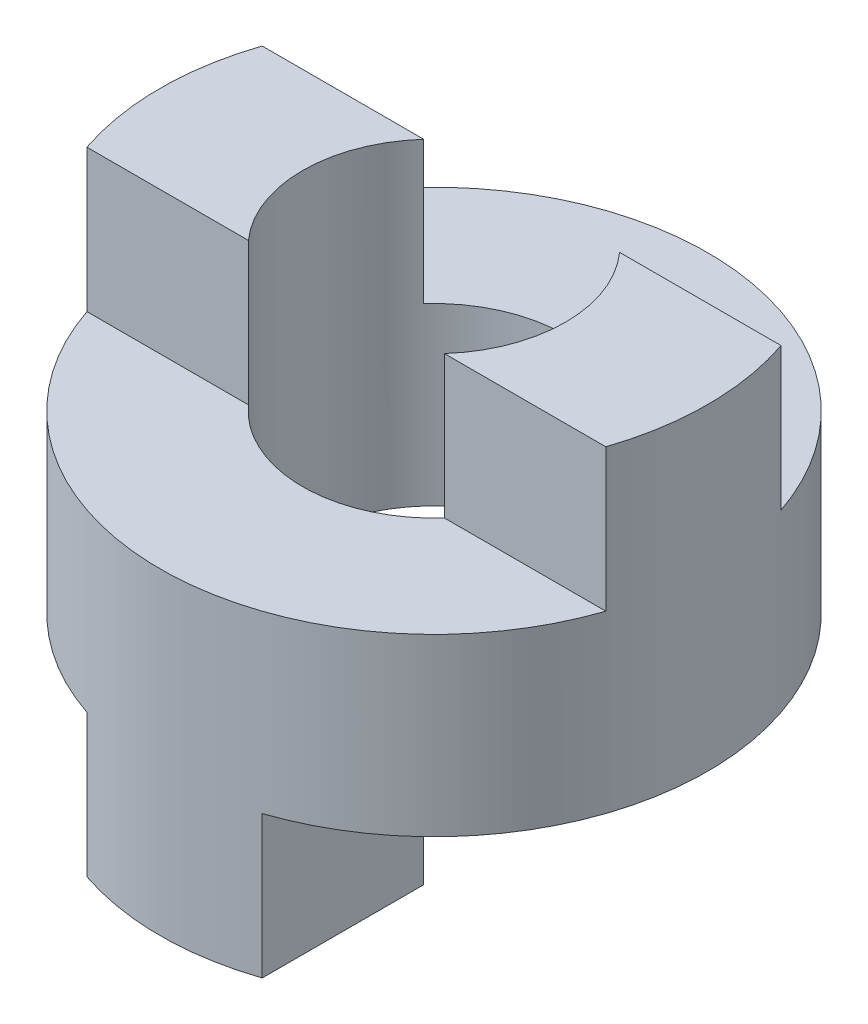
ISO-10303-21;
HEADER;
FILE_DESCRIPTION(('STEP AP214'),'2;1');
FILE_NAME('part.step','',(''),(''),'','','');
FILE_SCHEMA(('AUTOMOTIVE_DESIGN { 1 0 10303 214 1 1 1 1 }'));
ENDSEC;
DATA;
#1=APPLICATION_CONTEXT('core data for automotive mechanical design processes');
#2=APPLICATION_PROTOCOL_DEFINITION('international standard','automotive_design',2000,#1);
#3=PRODUCT_CONTEXT('',#1,'mechanical');
#4=PRODUCT('Part','Part','',(#3));
#5=PRODUCT_RELATED_PRODUCT_CATEGORY('part','',(#4));
#6=PRODUCT_DEFINITION_FORMATION('','',#4);
#7=PRODUCT_DEFINITION_CONTEXT('part definition',#1,'design');
#8=PRODUCT_DEFINITION('design','',#6,#7);
#9=PRODUCT_DEFINITION_SHAPE('','',#8);
#10=(LENGTH_UNIT() NAMED_UNIT(*) SI_UNIT(.MILLI.,.METRE.));
#11=(NAMED_UNIT(*) PLANE_ANGLE_UNIT() SI_UNIT($,.RADIAN.));
#12=(NAMED_UNIT(*) SI_UNIT($,.STERADIAN.) SOLID_ANGLE_UNIT());
#13=UNCERTAINTY_MEASURE_WITH_UNIT(LENGTH_MEASURE(1.E-05),#10,'distance_accuracy_value','');
#14=(GEOMETRIC_REPRESENTATION_CONTEXT(3) GLOBAL_UNCERTAINTY_ASSIGNED_CONTEXT((#13)) GLOBAL_UNIT_ASSIGNED_CONTEXT((#10,
#11,#12)) REPRESENTATION_CONTEXT('',''));
#15=CARTESIAN_POINT('',(0.,0.,0.));
#16=DIRECTION('',(0.,0.,1.));
#17=DIRECTION('',(1.,0.,0.));
#18=AXIS2_PLACEMENT_3D('',#15,#16,#17);
#19=CARTESIAN_POINT('',(0.,42.,0.));
#20=DIRECTION('',(0.,1.,0.));
#21=DIRECTION('',(0.,0.,1.));
#22=AXIS2_PLACEMENT_3D('',#19,#20,#21);
#23=PLANE('',#22);
#24=DIRECTION('',(1.,0.,0.));
#25=VECTOR('',#24,1.);
#26=CARTESIAN_POINT('',(-40.,42.,-8.));
#27=LINE('',#26,#25);
#28=CARTESIAN_POINT('',(-23.685438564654,42.,-8.));
#29=VERTEX_POINT('',#28);
#30=CARTESIAN_POINT('',(-8.94427190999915,42.,-8.));
#31=VERTEX_POINT('',#30);
#32=EDGE_CURVE('E150',#29,#31,#27,.T.);
#33=ORIENTED_EDGE('',*,*,#32,.F.);
#34=CARTESIAN_POINT('',(0.,42.,0.));
#35=DIRECTION('',(0.,1.,0.));
#36=DIRECTION('',(0.,0.,1.));
#37=AXIS2_PLACEMENT_3D('',#34,#35,#36);
#38=CIRCLE('',#37,25.);
#39=CARTESIAN_POINT('',(-23.685438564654,42.,8.));
#40=VERTEX_POINT('',#39);
#41=EDGE_CURVE('E163',#29,#40,#38,.T.);
#42=ORIENTED_EDGE('',*,*,#41,.T.);
#43=DIRECTION('',(1.,0.,0.));
#44=VECTOR('',#43,1.);
#45=CARTESIAN_POINT('',(-40.,42.,8.));
#46=LINE('',#45,#44);
#47=CARTESIAN_POINT('',(-8.94427190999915,42.,8.));
#48=VERTEX_POINT('',#47);
#49=EDGE_CURVE('E171',#40,#48,#46,.T.);
#50=ORIENTED_EDGE('',*,*,#49,.T.);
#51=CARTESIAN_POINT('',(0.,42.,0.));
#52=DIRECTION('',(0.,1.,0.));
#53=DIRECTION('',(0.,0.,1.));
#54=AXIS2_PLACEMENT_3D('',#51,#52,#53);
#55=CIRCLE('',#54,12.);
#56=EDGE_CURVE('E219',#31,#48,#55,.T.);
#57=ORIENTED_EDGE('',*,*,#56,.F.);
#58=EDGE_LOOP('',(#33,#42,#50,#57));
#59=FACE_BOUND('',#58,.T.);
#60=ADVANCED_FACE('F31',(#59),#23,.T.);
#61=CARTESIAN_POINT('',(0.,0.,0.));
#62=DIRECTION('',(0.,1.,0.));
#63=DIRECTION('',(0.,0.,1.));
#64=AXIS2_PLACEMENT_3D('',#61,#62,#63);
#65=PLANE('',#64);
#66=CARTESIAN_POINT('',(0.,0.,0.));
#67=DIRECTION('',(0.,1.,0.));
#68=DIRECTION('',(0.,0.,1.));
#69=AXIS2_PLACEMENT_3D('',#66,#67,#68);
#70=CIRCLE('',#69,25.);
#71=CARTESIAN_POINT('',(-8.,0.,23.685438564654));
#72=VERTEX_POINT('',#71);
#73=CARTESIAN_POINT('',(8.,0.,23.685438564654));
#74=VERTEX_POINT('',#73);
#75=EDGE_CURVE('E218',#72,#74,#70,.T.);
#76=ORIENTED_EDGE('',*,*,#75,.F.);
#77=DIRECTION('',(0.,0.,-1.));
#78=VECTOR('',#77,1.);
#79=CARTESIAN_POINT('',(-8.,0.,0.));
#80=LINE('',#79,#78);
#81=CARTESIAN_POINT('',(-8.,0.,8.94427190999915));
#82=VERTEX_POINT('',#81);
#83=EDGE_CURVE('E188',#72,#82,#80,.T.);
#84=ORIENTED_EDGE('',*,*,#83,.T.);
#85=CARTESIAN_POINT('',(0.,0.,0.));
#86=DIRECTION('',(0.,1.,0.));
#87=DIRECTION('',(0.,0.,1.));
#88=AXIS2_PLACEMENT_3D('',#85,#86,#87);
#89=CIRCLE('',#88,12.);
#90=CARTESIAN_POINT('',(8.,0.,8.94427190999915));
#91=VERTEX_POINT('',#90);
#92=EDGE_CURVE('E214',#82,#91,#89,.T.);
#93=ORIENTED_EDGE('',*,*,#92,.T.);
#94=DIRECTION('',(0.,0.,1.));
#95=VECTOR('',#94,1.);
#96=CARTESIAN_POINT('',(8.,0.,0.));
#97=LINE('',#96,#95);
#98=EDGE_CURVE('E204',#91,#74,#97,.T.);
#99=ORIENTED_EDGE('',*,*,#98,.T.);
#100=EDGE_LOOP('',(#76,#84,#93,#99));
#101=FACE_BOUND('',#100,.T.);
#102=ADVANCED_FACE('F285',(#101),#65,.F.);
#103=CARTESIAN_POINT('',(8.94427190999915,42.,-8.));
#104=VERTEX_POINT('',#103);
#105=CARTESIAN_POINT('',(23.685438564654,42.,-8.));
#106=VERTEX_POINT('',#105);
#107=EDGE_CURVE('E158',#104,#106,#27,.T.);
#108=ORIENTED_EDGE('',*,*,#107,.F.);
#109=CARTESIAN_POINT('',(8.94427190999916,42.,8.));
#110=VERTEX_POINT('',#109);
#111=EDGE_CURVE('E215',#110,#104,#55,.T.);
#112=ORIENTED_EDGE('',*,*,#111,.F.);
#113=CARTESIAN_POINT('',(23.685438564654,42.,8.));
#114=VERTEX_POINT('',#113);
#115=EDGE_CURVE('E169',#110,#114,#46,.T.);
#116=ORIENTED_EDGE('',*,*,#115,.T.);
#117=EDGE_CURVE('E223',#114,#106,#38,.T.);
#118=ORIENTED_EDGE('',*,*,#117,.T.);
#119=EDGE_LOOP('',(#108,#112,#116,#118));
#120=FACE_BOUND('',#119,.T.);
#121=ADVANCED_FACE('F257',(#120),#23,.T.);
#122=CARTESIAN_POINT('',(8.,0.,-8.94427190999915));
#123=VERTEX_POINT('',#122);
#124=CARTESIAN_POINT('',(-8.,0.,-8.94427190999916));
#125=VERTEX_POINT('',#124);
#126=EDGE_CURVE('E220',#123,#125,#89,.T.);
#127=ORIENTED_EDGE('',*,*,#126,.T.);
#128=CARTESIAN_POINT('',(-8.,0.,-23.685438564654));
#129=VERTEX_POINT('',#128);
#130=EDGE_CURVE('E184',#125,#129,#80,.T.);
#131=ORIENTED_EDGE('',*,*,#130,.T.);
#132=CARTESIAN_POINT('',(8.,0.,-23.685438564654));
#133=VERTEX_POINT('',#132);
#134=EDGE_CURVE('E227',#133,#129,#70,.T.);
#135=ORIENTED_EDGE('',*,*,#134,.F.);
#136=EDGE_CURVE('E208',#133,#123,#97,.T.);
#137=ORIENTED_EDGE('',*,*,#136,.T.);
#138=EDGE_LOOP('',(#127,#131,#135,#137));
#139=FACE_BOUND('',#138,.T.);
#140=ADVANCED_FACE('F292',(#139),#65,.F.);
#141=CARTESIAN_POINT('',(0.,42.,0.));
#142=DIRECTION('',(0.,-1.,0.));
#143=DIRECTION('',(0.,0.,-1.));
#144=AXIS2_PLACEMENT_3D('',#141,#142,#143);
#145=CYLINDRICAL_SURFACE('',#144,25.);
#146=ORIENTED_EDGE('',*,*,#41,.F.);
#147=DIRECTION('',(0.,-1.,0.));
#148=VECTOR('',#147,1.);
#149=CARTESIAN_POINT('',(-23.685438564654,42.,-8.));
#150=LINE('',#149,#148);
#151=CARTESIAN_POINT('',(-23.685438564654,29.,-8.));
#152=VERTEX_POINT('',#151);
#153=EDGE_CURVE('E154',#29,#152,#150,.T.);
#154=ORIENTED_EDGE('',*,*,#153,.T.);
#155=CARTESIAN_POINT('',(0.,29.,0.));
#156=DIRECTION('',(0.,-1.,0.));
#157=DIRECTION('',(0.,0.,-1.));
#158=AXIS2_PLACEMENT_3D('',#155,#156,#157);
#159=CIRCLE('',#158,25.);
#160=CARTESIAN_POINT('',(23.685438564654,29.,-8.));
#161=VERTEX_POINT('',#160);
#162=EDGE_CURVE('E141',#152,#161,#159,.T.);
#163=ORIENTED_EDGE('',*,*,#162,.T.);
#164=DIRECTION('',(0.,-1.,0.));
#165=VECTOR('',#164,1.);
#166=CARTESIAN_POINT('',(23.685438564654,42.,-8.));
#167=LINE('',#166,#165);
#168=EDGE_CURVE('E149',#161,#106,#167,.F.);
#169=ORIENTED_EDGE('',*,*,#168,.T.);
#170=ORIENTED_EDGE('',*,*,#117,.F.);
#171=DIRECTION('',(0.,-1.,0.));
#172=VECTOR('',#171,1.);
#173=CARTESIAN_POINT('',(23.685438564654,42.,8.));
#174=LINE('',#173,#172);
#175=CARTESIAN_POINT('',(23.685438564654,29.,8.));
#176=VERTEX_POINT('',#175);
#177=EDGE_CURVE('E177',#114,#176,#174,.T.);
#178=ORIENTED_EDGE('',*,*,#177,.T.);
#179=CARTESIAN_POINT('',(0.,29.,0.));
#180=DIRECTION('',(0.,-1.,0.));
#181=DIRECTION('',(0.,0.,-1.));
#182=AXIS2_PLACEMENT_3D('',#179,#180,#181);
#183=CIRCLE('',#182,25.);
#184=CARTESIAN_POINT('',(-23.685438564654,29.,8.));
#185=VERTEX_POINT('',#184);
#186=EDGE_CURVE('E173',#176,#185,#183,.T.);
#187=ORIENTED_EDGE('',*,*,#186,.T.);
#188=DIRECTION('',(0.,-1.,0.));
#189=VECTOR('',#188,1.);
#190=CARTESIAN_POINT('',(-23.685438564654,42.,8.));
#191=LINE('',#190,#189);
#192=EDGE_CURVE('E175',#185,#40,#191,.F.);
#193=ORIENTED_EDGE('',*,*,#192,.T.);
#194=EDGE_LOOP('',(#146,#154,#163,#169,#170,#178,#187,#193));
#195=FACE_BOUND('',#194,.T.);
#196=CARTESIAN_POINT('',(0.,13.,0.));
#197=DIRECTION('',(0.,1.,0.));
#198=DIRECTION('',(0.,0.,1.));
#199=AXIS2_PLACEMENT_3D('',#196,#197,#198);
#200=CIRCLE('',#199,25.);
#201=CARTESIAN_POINT('',(-8.,13.,-23.685438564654));
#202=VERTEX_POINT('',#201);
#203=CARTESIAN_POINT('',(-8.,13.,23.685438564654));
#204=VERTEX_POINT('',#203);
#205=EDGE_CURVE('E194',#202,#204,#200,.T.);
#206=ORIENTED_EDGE('',*,*,#205,.T.);
#207=DIRECTION('',(0.,-1.,0.));
#208=VECTOR('',#207,1.);
#209=CARTESIAN_POINT('',(-8.,42.,23.685438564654));
#210=LINE('',#209,#208);
#211=EDGE_CURVE('E191',#204,#72,#210,.T.);
#212=ORIENTED_EDGE('',*,*,#211,.T.);
#213=ORIENTED_EDGE('',*,*,#75,.T.);
#214=DIRECTION('',(0.,-1.,0.));
#215=VECTOR('',#214,1.);
#216=CARTESIAN_POINT('',(8.,42.,23.685438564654));
#217=LINE('',#216,#215);
#218=CARTESIAN_POINT('',(8.,13.,23.685438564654));
#219=VERTEX_POINT('',#218);
#220=EDGE_CURVE('E207',#74,#219,#217,.F.);
#221=ORIENTED_EDGE('',*,*,#220,.T.);
#222=CARTESIAN_POINT('',(0.,13.,0.));
#223=DIRECTION('',(0.,1.,0.));
#224=DIRECTION('',(0.,0.,1.));
#225=AXIS2_PLACEMENT_3D('',#222,#223,#224);
#226=CIRCLE('',#225,25.);
#227=CARTESIAN_POINT('',(8.,13.,-23.685438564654));
#228=VERTEX_POINT('',#227);
#229=EDGE_CURVE('E201',#219,#228,#226,.T.);
#230=ORIENTED_EDGE('',*,*,#229,.T.);
#231=DIRECTION('',(0.,-1.,0.));
#232=VECTOR('',#231,1.);
#233=CARTESIAN_POINT('',(8.,42.,-23.685438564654));
#234=LINE('',#233,#232);
#235=EDGE_CURVE('E211',#228,#133,#234,.T.);
#236=ORIENTED_EDGE('',*,*,#235,.T.);
#237=ORIENTED_EDGE('',*,*,#134,.T.);
#238=DIRECTION('',(0.,-1.,0.));
#239=VECTOR('',#238,1.);
#240=CARTESIAN_POINT('',(-8.,42.,-23.685438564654));
#241=LINE('',#240,#239);
#242=EDGE_CURVE('E187',#129,#202,#241,.F.);
#243=ORIENTED_EDGE('',*,*,#242,.T.);
#244=EDGE_LOOP('',(#206,#212,#213,#221,#230,#236,#237,#243));
#245=FACE_BOUND('',#244,.T.);
#246=ADVANCED_FACE('F33',(#195,#245),#145,.T.);
#247=CARTESIAN_POINT('',(0.,42.,0.));
#248=DIRECTION('',(0.,-1.,0.));
#249=DIRECTION('',(0.,0.,-1.));
#250=AXIS2_PLACEMENT_3D('',#247,#248,#249);
#251=CYLINDRICAL_SURFACE('',#250,12.);
#252=DIRECTION('',(0.,-1.,0.));
#253=VECTOR('',#252,1.);
#254=CARTESIAN_POINT('',(-8.94427190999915,42.,-8.));
#255=LINE('',#254,#253);
#256=CARTESIAN_POINT('',(-8.94427190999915,29.,-8.));
#257=VERTEX_POINT('',#256);
#258=EDGE_CURVE('E11',#31,#257,#255,.T.);
#259=ORIENTED_EDGE('',*,*,#258,.F.);
#260=ORIENTED_EDGE('',*,*,#56,.T.);
#261=DIRECTION('',(0.,-1.,0.));
#262=VECTOR('',#261,1.);
#263=CARTESIAN_POINT('',(-8.94427190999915,42.,8.));
#264=LINE('',#263,#262);
#265=CARTESIAN_POINT('',(-8.94427190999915,29.,8.));
#266=VERTEX_POINT('',#265);
#267=EDGE_CURVE('E244',#266,#48,#264,.F.);
#268=ORIENTED_EDGE('',*,*,#267,.F.);
#269=CARTESIAN_POINT('',(0.,29.,0.));
#270=DIRECTION('',(0.,-1.,0.));
#271=DIRECTION('',(0.,0.,-1.));
#272=AXIS2_PLACEMENT_3D('',#269,#270,#271);
#273=CIRCLE('',#272,12.);
#274=CARTESIAN_POINT('',(8.94427190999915,29.,8.));
#275=VERTEX_POINT('',#274);
#276=EDGE_CURVE('E242',#275,#266,#273,.T.);
#277=ORIENTED_EDGE('',*,*,#276,.F.);
#278=DIRECTION('',(0.,-1.,0.));
#279=VECTOR('',#278,1.);
#280=CARTESIAN_POINT('',(8.94427190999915,42.,8.));
#281=LINE('',#280,#279);
#282=EDGE_CURVE('E247',#110,#275,#281,.T.);
#283=ORIENTED_EDGE('',*,*,#282,.F.);
#284=ORIENTED_EDGE('',*,*,#111,.T.);
#285=DIRECTION('',(0.,-1.,0.));
#286=VECTOR('',#285,1.);
#287=CARTESIAN_POINT('',(8.94427190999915,42.,-8.));
#288=LINE('',#287,#286);
#289=CARTESIAN_POINT('',(8.94427190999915,29.,-8.));
#290=VERTEX_POINT('',#289);
#291=EDGE_CURVE('E39',#290,#104,#288,.F.);
#292=ORIENTED_EDGE('',*,*,#291,.F.);
#293=CARTESIAN_POINT('',(0.,29.,0.));
#294=DIRECTION('',(0.,-1.,0.));
#295=DIRECTION('',(0.,0.,-1.));
#296=AXIS2_PLACEMENT_3D('',#293,#294,#295);
#297=CIRCLE('',#296,12.);
#298=EDGE_CURVE('E249',#257,#290,#297,.T.);
#299=ORIENTED_EDGE('',*,*,#298,.F.);
#300=EDGE_LOOP('',(#259,#260,#268,#277,#283,#284,#292,#299));
#301=FACE_BOUND('',#300,.T.);
#302=DIRECTION('',(0.,-1.,0.));
#303=VECTOR('',#302,1.);
#304=CARTESIAN_POINT('',(-8.,42.,8.94427190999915));
#305=LINE('',#304,#303);
#306=CARTESIAN_POINT('',(-8.,13.,8.94427190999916));
#307=VERTEX_POINT('',#306);
#308=EDGE_CURVE('E240',#307,#82,#305,.T.);
#309=ORIENTED_EDGE('',*,*,#308,.F.);
#310=CARTESIAN_POINT('',(0.,13.,0.));
#311=DIRECTION('',(0.,1.,0.));
#312=DIRECTION('',(0.,0.,1.));
#313=AXIS2_PLACEMENT_3D('',#310,#311,#312);
#314=CIRCLE('',#313,12.);
#315=CARTESIAN_POINT('',(-8.,13.,-8.94427190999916));
#316=VERTEX_POINT('',#315);
#317=EDGE_CURVE('E238',#316,#307,#314,.T.);
#318=ORIENTED_EDGE('',*,*,#317,.F.);
#319=DIRECTION('',(0.,-1.,0.));
#320=VECTOR('',#319,1.);
#321=CARTESIAN_POINT('',(-8.,42.,-8.94427190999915));
#322=LINE('',#321,#320);
#323=EDGE_CURVE('E236',#125,#316,#322,.F.);
#324=ORIENTED_EDGE('',*,*,#323,.F.);
#325=ORIENTED_EDGE('',*,*,#126,.F.);
#326=DIRECTION('',(0.,-1.,0.));
#327=VECTOR('',#326,1.);
#328=CARTESIAN_POINT('',(8.,42.,-8.94427190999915));
#329=LINE('',#328,#327);
#330=CARTESIAN_POINT('',(8.,13.,-8.94427190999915));
#331=VERTEX_POINT('',#330);
#332=EDGE_CURVE('E234',#331,#123,#329,.T.);
#333=ORIENTED_EDGE('',*,*,#332,.F.);
#334=CARTESIAN_POINT('',(0.,13.,0.));
#335=DIRECTION('',(0.,1.,0.));
#336=DIRECTION('',(0.,0.,1.));
#337=AXIS2_PLACEMENT_3D('',#334,#335,#336);
#338=CIRCLE('',#337,12.);
#339=CARTESIAN_POINT('',(8.,13.,8.94427190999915));
#340=VERTEX_POINT('',#339);
#341=EDGE_CURVE('E226',#340,#331,#338,.T.);
#342=ORIENTED_EDGE('',*,*,#341,.F.);
#343=DIRECTION('',(0.,-1.,0.));
#344=VECTOR('',#343,1.);
#345=CARTESIAN_POINT('',(8.,42.,8.94427190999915));
#346=LINE('',#345,#344);
#347=EDGE_CURVE('E231',#91,#340,#346,.F.);
#348=ORIENTED_EDGE('',*,*,#347,.F.);
#349=ORIENTED_EDGE('',*,*,#92,.F.);
#350=EDGE_LOOP('',(#309,#318,#324,#325,#333,#342,#348,#349));
#351=FACE_BOUND('',#350,.T.);
#352=ADVANCED_FACE('F261',(#301,#351),#251,.F.);
#353=CARTESIAN_POINT('',(8.,13.,-40.));
#354=DIRECTION('',(-1.,0.,0.));
#355=DIRECTION('',(0.,-1.,0.));
#356=AXIS2_PLACEMENT_3D('',#353,#354,#355);
#357=PLANE('',#356);
#358=DIRECTION('',(0.,0.,1.));
#359=VECTOR('',#358,1.);
#360=CARTESIAN_POINT('',(8.,13.,-40.));
#361=LINE('',#360,#359);
#362=EDGE_CURVE('E200',#228,#331,#361,.T.);
#363=ORIENTED_EDGE('',*,*,#362,.T.);
#364=ORIENTED_EDGE('',*,*,#332,.T.);
#365=ORIENTED_EDGE('',*,*,#136,.F.);
#366=ORIENTED_EDGE('',*,*,#235,.F.);
#367=EDGE_LOOP('',(#363,#364,#365,#366));
#368=FACE_BOUND('',#367,.T.);
#369=ADVANCED_FACE('F321',(#368),#357,.F.);
#370=ORIENTED_EDGE('',*,*,#98,.F.);
#371=ORIENTED_EDGE('',*,*,#347,.T.);
#372=EDGE_CURVE('E197',#340,#219,#361,.T.);
#373=ORIENTED_EDGE('',*,*,#372,.T.);
#374=ORIENTED_EDGE('',*,*,#220,.F.);
#375=EDGE_LOOP('',(#370,#371,#373,#374));
#376=FACE_BOUND('',#375,.T.);
#377=ADVANCED_FACE('F328',(#376),#357,.F.);
#378=CARTESIAN_POINT('',(8.,13.,-40.));
#379=DIRECTION('',(0.,1.,0.));
#380=DIRECTION('',(0.,0.,1.));
#381=AXIS2_PLACEMENT_3D('',#378,#379,#380);
#382=PLANE('',#381);
#383=ORIENTED_EDGE('',*,*,#372,.F.);
#384=ORIENTED_EDGE('',*,*,#341,.T.);
#385=ORIENTED_EDGE('',*,*,#362,.F.);
#386=ORIENTED_EDGE('',*,*,#229,.F.);
#387=EDGE_LOOP('',(#383,#384,#385,#386));
#388=FACE_BOUND('',#387,.T.);
#389=ADVANCED_FACE('F323',(#388),#382,.F.);
#390=CARTESIAN_POINT('',(-8.,13.,-40.));
#391=DIRECTION('',(0.,1.,0.));
#392=DIRECTION('',(0.,0.,1.));
#393=AXIS2_PLACEMENT_3D('',#390,#391,#392);
#394=PLANE('',#393);
#395=DIRECTION('',(0.,0.,1.));
#396=VECTOR('',#395,1.);
#397=CARTESIAN_POINT('',(-8.,13.,-40.));
#398=LINE('',#397,#396);
#399=EDGE_CURVE('E183',#202,#316,#398,.T.);
#400=ORIENTED_EDGE('',*,*,#399,.T.);
#401=ORIENTED_EDGE('',*,*,#317,.T.);
#402=EDGE_CURVE('E180',#307,#204,#398,.T.);
#403=ORIENTED_EDGE('',*,*,#402,.T.);
#404=ORIENTED_EDGE('',*,*,#205,.F.);
#405=EDGE_LOOP('',(#400,#401,#403,#404));
#406=FACE_BOUND('',#405,.T.);
#407=ADVANCED_FACE('F315',(#406),#394,.F.);
#408=CARTESIAN_POINT('',(-8.,13.,-40.));
#409=DIRECTION('',(1.,0.,0.));
#410=DIRECTION('',(0.,1.,0.));
#411=AXIS2_PLACEMENT_3D('',#408,#409,#410);
#412=PLANE('',#411);
#413=ORIENTED_EDGE('',*,*,#402,.F.);
#414=ORIENTED_EDGE('',*,*,#308,.T.);
#415=ORIENTED_EDGE('',*,*,#83,.F.);
#416=ORIENTED_EDGE('',*,*,#211,.F.);
#417=EDGE_LOOP('',(#413,#414,#415,#416));
#418=FACE_BOUND('',#417,.T.);
#419=ADVANCED_FACE('F332',(#418),#412,.F.);
#420=ORIENTED_EDGE('',*,*,#130,.F.);
#421=ORIENTED_EDGE('',*,*,#323,.T.);
#422=ORIENTED_EDGE('',*,*,#399,.F.);
#423=ORIENTED_EDGE('',*,*,#242,.F.);
#424=EDGE_LOOP('',(#420,#421,#422,#423));
#425=FACE_BOUND('',#424,.T.);
#426=ADVANCED_FACE('F313',(#425),#412,.F.);
#427=CARTESIAN_POINT('',(-40.,42.,8.));
#428=DIRECTION('',(0.,0.,-1.));
#429=DIRECTION('',(-1.,0.,0.));
#430=AXIS2_PLACEMENT_3D('',#427,#428,#429);
#431=PLANE('',#430);
#432=ORIENTED_EDGE('',*,*,#115,.F.);
#433=ORIENTED_EDGE('',*,*,#282,.T.);
#434=DIRECTION('',(1.,0.,0.));
#435=VECTOR('',#434,1.);
#436=CARTESIAN_POINT('',(-40.,29.,8.));
#437=LINE('',#436,#435);
#438=EDGE_CURVE('E53',#275,#176,#437,.T.);
#439=ORIENTED_EDGE('',*,*,#438,.T.);
#440=ORIENTED_EDGE('',*,*,#177,.F.);
#441=EDGE_LOOP('',(#432,#433,#439,#440));
#442=FACE_BOUND('',#441,.T.);
#443=ADVANCED_FACE('F266',(#442),#431,.F.);
#444=EDGE_CURVE('E165',#185,#266,#437,.T.);
#445=ORIENTED_EDGE('',*,*,#444,.T.);
#446=ORIENTED_EDGE('',*,*,#267,.T.);
#447=ORIENTED_EDGE('',*,*,#49,.F.);
#448=ORIENTED_EDGE('',*,*,#192,.F.);
#449=EDGE_LOOP('',(#445,#446,#447,#448));
#450=FACE_BOUND('',#449,.T.);
#451=ADVANCED_FACE('F272',(#450),#431,.F.);
#452=CARTESIAN_POINT('',(-40.,29.,8.));
#453=DIRECTION('',(0.,-1.,0.));
#454=DIRECTION('',(0.,0.,-1.));
#455=AXIS2_PLACEMENT_3D('',#452,#453,#454);
#456=PLANE('',#455);
#457=ORIENTED_EDGE('',*,*,#438,.F.);
#458=ORIENTED_EDGE('',*,*,#276,.T.);
#459=ORIENTED_EDGE('',*,*,#444,.F.);
#460=ORIENTED_EDGE('',*,*,#186,.F.);
#461=EDGE_LOOP('',(#457,#458,#459,#460));
#462=FACE_BOUND('',#461,.T.);
#463=ADVANCED_FACE('F274',(#462),#456,.F.);
#464=CARTESIAN_POINT('',(-40.,42.,-8.));
#465=DIRECTION('',(0.,0.,1.));
#466=DIRECTION('',(1.,0.,0.));
#467=AXIS2_PLACEMENT_3D('',#464,#465,#466);
#468=PLANE('',#467);
#469=ORIENTED_EDGE('',*,*,#32,.T.);
#470=ORIENTED_EDGE('',*,*,#258,.T.);
#471=DIRECTION('',(1.,0.,0.));
#472=VECTOR('',#471,1.);
#473=CARTESIAN_POINT('',(-40.,29.,-8.));
#474=LINE('',#473,#472);
#475=EDGE_CURVE('E46',#152,#257,#474,.T.);
#476=ORIENTED_EDGE('',*,*,#475,.F.);
#477=ORIENTED_EDGE('',*,*,#153,.F.);
#478=EDGE_LOOP('',(#469,#470,#476,#477));
#479=FACE_BOUND('',#478,.T.);
#480=ADVANCED_FACE('F153',(#479),#468,.F.);
#481=EDGE_CURVE('E144',#290,#161,#474,.T.);
#482=ORIENTED_EDGE('',*,*,#481,.F.);
#483=ORIENTED_EDGE('',*,*,#291,.T.);
#484=ORIENTED_EDGE('',*,*,#107,.T.);
#485=ORIENTED_EDGE('',*,*,#168,.F.);
#486=EDGE_LOOP('',(#482,#483,#484,#485));
#487=FACE_BOUND('',#486,.T.);
#488=ADVANCED_FACE('F253',(#487),#468,.F.);
#489=CARTESIAN_POINT('',(-40.,29.,-8.));
#490=DIRECTION('',(0.,-1.,0.));
#491=DIRECTION('',(0.,0.,-1.));
#492=AXIS2_PLACEMENT_3D('',#489,#490,#491);
#493=PLANE('',#492);
#494=ORIENTED_EDGE('',*,*,#162,.F.);
#495=ORIENTED_EDGE('',*,*,#475,.T.);
#496=ORIENTED_EDGE('',*,*,#298,.T.);
#497=ORIENTED_EDGE('',*,*,#481,.T.);
#498=EDGE_LOOP('',(#494,#495,#496,#497));
#499=FACE_BOUND('',#498,.T.);
#500=ADVANCED_FACE('F142',(#499),#493,.F.);
#501=CLOSED_SHELL('',(#60,#102,#121,#140,#246,#352,#369,#377,#389,#407,#419,#426,#443,#451,#463,
#480,#488,#500));
#502=MANIFOLD_SOLID_BREP('B2',#501);
#503=ADVANCED_BREP_SHAPE_REPRESENTATION('',(#18,#502),#14);
#504=SHAPE_DEFINITION_REPRESENTATION(#9,#503);
ENDSEC;
END-ISO-10303-21;
